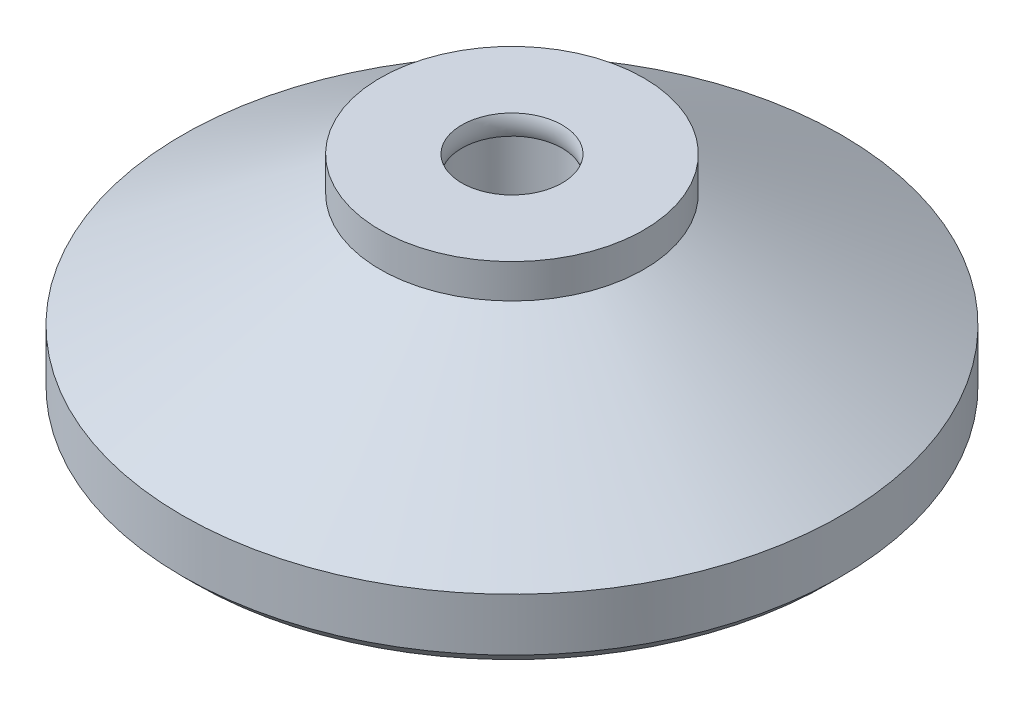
ISO-10303-21;
HEADER;
FILE_DESCRIPTION(('STEP AP214'),'2;1');
FILE_NAME('part.step','',(''),(''),'','','');
FILE_SCHEMA(('AUTOMOTIVE_DESIGN { 1 0 10303 214 1 1 1 1 }'));
ENDSEC;
DATA;
#1=APPLICATION_CONTEXT('core data for automotive mechanical design processes');
#2=APPLICATION_PROTOCOL_DEFINITION('international standard','automotive_design',2000,#1);
#3=PRODUCT_CONTEXT('',#1,'mechanical');
#4=PRODUCT('Part','Part','',(#3));
#5=PRODUCT_RELATED_PRODUCT_CATEGORY('part','',(#4));
#6=PRODUCT_DEFINITION_FORMATION('','',#4);
#7=PRODUCT_DEFINITION_CONTEXT('part definition',#1,'design');
#8=PRODUCT_DEFINITION('design','',#6,#7);
#9=PRODUCT_DEFINITION_SHAPE('','',#8);
#10=(LENGTH_UNIT() NAMED_UNIT(*) SI_UNIT(.MILLI.,.METRE.));
#11=(NAMED_UNIT(*) PLANE_ANGLE_UNIT() SI_UNIT($,.RADIAN.));
#12=(NAMED_UNIT(*) SI_UNIT($,.STERADIAN.) SOLID_ANGLE_UNIT());
#13=UNCERTAINTY_MEASURE_WITH_UNIT(LENGTH_MEASURE(1.E-05),#10,'distance_accuracy_value','');
#14=(GEOMETRIC_REPRESENTATION_CONTEXT(3) GLOBAL_UNCERTAINTY_ASSIGNED_CONTEXT((#13)) GLOBAL_UNIT_ASSIGNED_CONTEXT((#10,
#11,#12)) REPRESENTATION_CONTEXT('',''));
#15=CARTESIAN_POINT('',(0.,0.,0.));
#16=DIRECTION('',(0.,0.,1.));
#17=DIRECTION('',(1.,0.,0.));
#18=AXIS2_PLACEMENT_3D('',#15,#16,#17);
#19=CARTESIAN_POINT('',(0.,6.5,0.));
#20=DIRECTION('',(0.,-1.,0.));
#21=DIRECTION('',(0.,0.,-1.));
#22=AXIS2_PLACEMENT_3D('',#19,#20,#21);
#23=CYLINDRICAL_SURFACE('',#22,8.);
#24=CARTESIAN_POINT('',(0.,4.42820323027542,0.));
#25=DIRECTION('',(0.,1.,0.));
#26=DIRECTION('',(0.,0.,1.));
#27=AXIS2_PLACEMENT_3D('',#24,#25,#26);
#28=CIRCLE('',#27,8.);
#29=CARTESIAN_POINT('',(0.,4.42820323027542,-8.));
#30=VERTEX_POINT('',#29);
#31=EDGE_CURVE('E91',#30,#30,#28,.T.);
#32=CARTESIAN_POINT('',(0.,6.5,0.));
#33=DIRECTION('',(0.,1.,0.));
#34=DIRECTION('',(0.,0.,1.));
#35=AXIS2_PLACEMENT_3D('',#32,#33,#34);
#36=CIRCLE('',#35,8.);
#37=CARTESIAN_POINT('',(0.,6.5,-8.));
#38=VERTEX_POINT('',#37);
#39=EDGE_CURVE('E93',#38,#38,#36,.T.);
#40=CARTESIAN_POINT('',(0.,4.42820323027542,-8.));
#41=CARTESIAN_POINT('',(0.,4.44978444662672,-8.));
#42=CARTESIAN_POINT('',(0.,4.47136566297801,-8.));
#43=CARTESIAN_POINT('',(0.,4.51452809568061,-8.));
#44=CARTESIAN_POINT('',(0.,4.53610931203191,-8.));
#45=CARTESIAN_POINT('',(0.,4.5792717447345,-8.));
#46=CARTESIAN_POINT('',(0.,4.6008529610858,-8.));
#47=CARTESIAN_POINT('',(0.,4.6440153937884,-8.));
#48=CARTESIAN_POINT('',(0.,4.66559661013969,-8.));
#49=CARTESIAN_POINT('',(0.,4.70875904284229,-8.));
#50=CARTESIAN_POINT('',(0.,4.73034025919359,-8.));
#51=CARTESIAN_POINT('',(0.,4.77350269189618,-8.));
#52=CARTESIAN_POINT('',(0.,4.79508390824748,-8.));
#53=CARTESIAN_POINT('',(0.,4.83824634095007,-8.));
#54=CARTESIAN_POINT('',(0.,4.85982755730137,-8.));
#55=CARTESIAN_POINT('',(0.,4.90298999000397,-8.));
#56=CARTESIAN_POINT('',(0.,4.92457120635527,-8.));
#57=CARTESIAN_POINT('',(0.,4.96773363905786,-8.));
#58=CARTESIAN_POINT('',(0.,4.98931485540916,-8.));
#59=CARTESIAN_POINT('',(0.,5.03247728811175,-8.));
#60=CARTESIAN_POINT('',(0.,5.05405850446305,-8.));
#61=CARTESIAN_POINT('',(0.,5.09722093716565,-8.));
#62=CARTESIAN_POINT('',(0.,5.11880215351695,-8.));
#63=CARTESIAN_POINT('',(0.,5.16196458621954,-8.));
#64=CARTESIAN_POINT('',(0.,5.18354580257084,-8.));
#65=CARTESIAN_POINT('',(0.,5.22670823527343,-8.));
#66=CARTESIAN_POINT('',(0.,5.24828945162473,-8.));
#67=CARTESIAN_POINT('',(0.,5.29145188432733,-8.));
#68=CARTESIAN_POINT('',(0.,5.31303310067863,-8.));
#69=CARTESIAN_POINT('',(0.,5.35619553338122,-8.));
#70=CARTESIAN_POINT('',(0.,5.37777674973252,-8.));
#71=CARTESIAN_POINT('',(0.,5.42093918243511,-8.));
#72=CARTESIAN_POINT('',(0.,5.44252039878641,-8.));
#73=CARTESIAN_POINT('',(0.,5.48568283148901,-8.));
#74=CARTESIAN_POINT('',(0.,5.5072640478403,-8.));
#75=CARTESIAN_POINT('',(0.,5.5504264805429,-8.));
#76=CARTESIAN_POINT('',(0.,5.5720076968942,-8.));
#77=CARTESIAN_POINT('',(0.,5.61517012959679,-8.));
#78=CARTESIAN_POINT('',(0.,5.63675134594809,-8.));
#79=CARTESIAN_POINT('',(0.,5.67991377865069,-8.));
#80=CARTESIAN_POINT('',(0.,5.70149499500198,-8.));
#81=CARTESIAN_POINT('',(0.,5.74465742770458,-8.));
#82=CARTESIAN_POINT('',(0.,5.76623864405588,-8.));
#83=CARTESIAN_POINT('',(0.,5.80940107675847,-8.));
#84=CARTESIAN_POINT('',(0.,5.83098229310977,-8.));
#85=CARTESIAN_POINT('',(0.,5.87414472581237,-8.));
#86=CARTESIAN_POINT('',(0.,5.89572594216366,-8.));
#87=CARTESIAN_POINT('',(0.,5.93888837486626,-8.));
#88=CARTESIAN_POINT('',(0.,5.96046959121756,-8.));
#89=CARTESIAN_POINT('',(0.,6.00363202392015,-8.));
#90=CARTESIAN_POINT('',(0.,6.02521324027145,-8.));
#91=CARTESIAN_POINT('',(0.,6.06837567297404,-8.));
#92=CARTESIAN_POINT('',(0.,6.08995688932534,-8.));
#93=CARTESIAN_POINT('',(0.,6.13311932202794,-8.));
#94=CARTESIAN_POINT('',(0.,6.15470053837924,-8.));
#95=CARTESIAN_POINT('',(0.,6.19786297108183,-8.));
#96=CARTESIAN_POINT('',(0.,6.21944418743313,-8.));
#97=CARTESIAN_POINT('',(0.,6.26260662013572,-8.));
#98=CARTESIAN_POINT('',(0.,6.28418783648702,-8.));
#99=CARTESIAN_POINT('',(0.,6.32735026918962,-8.));
#100=CARTESIAN_POINT('',(0.,6.34893148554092,-8.));
#101=CARTESIAN_POINT('',(0.,6.39209391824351,-8.));
#102=CARTESIAN_POINT('',(0.,6.41367513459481,-8.));
#103=CARTESIAN_POINT('',(0.,6.4568375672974,-8.));
#104=CARTESIAN_POINT('',(0.,6.4784187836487,-8.));
#105=CARTESIAN_POINT('',(0.,6.5,-8.));
#106=B_SPLINE_CURVE_WITH_KNOTS('',3,(#40,#41,#42,#43,#44,#45,#46,#47,#48,#49,#50,#51,#52,#53,
#54,#55,#56,#57,#58,#59,#60,#61,#62,#63,#64,#65,#66,#67,#68,#69,#70,#71,#72,#73,#74,#75,#76,#77,
#78,#79,#80,#81,#82,#83,#84,#85,#86,#87,#88,#89,#90,#91,#92,#93,#94,#95,#96,#97,#98,#99,#100,
#101,#102,#103,#104,#105),.UNSPECIFIED.,.F.,.F.,(4,2,2,2,2,2,2,2,2,2,2,2,2,2,2,2,2,2,2,2,2,2,2,
2,2,2,2,2,2,2,2,2,4),(0.,0.064743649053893,0.129487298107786,0.194230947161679,
0.258974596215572,0.323718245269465,0.388461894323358,0.453205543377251,0.517949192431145,
0.582692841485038,0.647436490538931,0.712180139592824,0.776923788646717,0.841667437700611,
0.906411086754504,0.971154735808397,1.03589838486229,1.10064203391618,1.16538568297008,
1.23012933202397,1.29487298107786,1.35961663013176,1.42436027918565,1.48910392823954,
1.55384757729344,1.61859122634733,1.68333487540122,1.74807852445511,1.81282217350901,
1.8775658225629,1.94230947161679,2.00705312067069,2.07179676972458),.UNSPECIFIED.);
#107=EDGE_CURVE('BSEAM37',#30,#38,#106,.T.);
#108=ORIENTED_EDGE('',*,*,#31,.T.);
#109=ORIENTED_EDGE('',*,*,#39,.F.);
#110=ORIENTED_EDGE('',*,*,#107,.T.);
#111=ORIENTED_EDGE('',*,*,#107,.F.);
#112=EDGE_LOOP('',(#108,#110,#109,#111));
#113=FACE_BOUND('',#112,.T.);
#114=ADVANCED_FACE('F37',(#113),#23,.T.);
#115=CARTESIAN_POINT('',(0.,6.5,0.));
#116=DIRECTION('',(0.,1.,0.));
#117=DIRECTION('',(0.,0.,1.));
#118=AXIS2_PLACEMENT_3D('',#115,#116,#117);
#119=PLANE('',#118);
#120=CARTESIAN_POINT('',(0.,6.5,0.));
#121=DIRECTION('',(0.,-1.,0.));
#122=DIRECTION('',(0.,0.,-1.));
#123=AXIS2_PLACEMENT_3D('',#120,#121,#122);
#124=CIRCLE('',#123,3.05);
#125=CARTESIAN_POINT('',(0.,6.5,-3.05));
#126=VERTEX_POINT('',#125);
#127=EDGE_CURVE('E111',#126,#126,#124,.T.);
#128=ORIENTED_EDGE('',*,*,#127,.T.);
#129=EDGE_LOOP('',(#128));
#130=FACE_BOUND('',#129,.T.);
#131=ORIENTED_EDGE('',*,*,#39,.T.);
#132=EDGE_LOOP('',(#131));
#133=FACE_BOUND('',#132,.T.);
#134=ADVANCED_FACE('F65',(#130,#133),#119,.T.);
#135=CARTESIAN_POINT('',(0.,4.42820323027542,0.));
#136=DIRECTION('',(0.,-1.,0.));
#137=DIRECTION('',(0.,0.,-1.));
#138=AXIS2_PLACEMENT_3D('',#135,#136,#137);
#139=CONICAL_SURFACE('',#138,8.,1.0471975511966);
#140=CARTESIAN_POINT('',(0.,-2.5,0.));
#141=DIRECTION('',(0.,1.,0.));
#142=DIRECTION('',(0.,0.,1.));
#143=AXIS2_PLACEMENT_3D('',#140,#141,#142);
#144=CIRCLE('',#143,20.);
#145=CARTESIAN_POINT('',(0.,-2.5,20.));
#146=VERTEX_POINT('',#145);
#147=EDGE_CURVE('E89',#146,#146,#144,.T.);
#148=ORIENTED_EDGE('',*,*,#147,.T.);
#149=EDGE_LOOP('',(#148));
#150=FACE_BOUND('',#149,.T.);
#151=ORIENTED_EDGE('',*,*,#31,.F.);
#152=EDGE_LOOP('',(#151));
#153=FACE_BOUND('',#152,.T.);
#154=ADVANCED_FACE('F70',(#150,#153),#139,.T.);
#155=CARTESIAN_POINT('',(0.,-6.5,0.));
#156=DIRECTION('',(0.,1.,0.));
#157=DIRECTION('',(0.,0.,1.));
#158=AXIS2_PLACEMENT_3D('',#155,#156,#157);
#159=PLANE('',#158);
#160=CARTESIAN_POINT('',(0.,-6.5,0.));
#161=DIRECTION('',(0.,1.,0.));
#162=DIRECTION('',(0.,0.,1.));
#163=AXIS2_PLACEMENT_3D('',#160,#161,#162);
#164=CIRCLE('',#163,19.2);
#165=CARTESIAN_POINT('',(0.,-6.5,19.2));
#166=VERTEX_POINT('',#165);
#167=EDGE_CURVE('E45',#166,#166,#164,.F.);
#168=ORIENTED_EDGE('',*,*,#167,.T.);
#169=EDGE_LOOP('',(#168));
#170=FACE_BOUND('',#169,.T.);
#171=ADVANCED_FACE('F76',(#170),#159,.F.);
#172=CARTESIAN_POINT('',(0.,-2.5,0.));
#173=DIRECTION('',(0.,-1.,0.));
#174=DIRECTION('',(0.,0.,-1.));
#175=AXIS2_PLACEMENT_3D('',#172,#173,#174);
#176=CYLINDRICAL_SURFACE('',#175,20.);
#177=CARTESIAN_POINT('',(0.,-5.69999999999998,0.));
#178=DIRECTION('',(0.,1.,0.));
#179=DIRECTION('',(0.,0.,1.));
#180=AXIS2_PLACEMENT_3D('',#177,#178,#179);
#181=CIRCLE('',#180,20.);
#182=CARTESIAN_POINT('',(0.,-5.69999999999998,20.));
#183=VERTEX_POINT('',#182);
#184=EDGE_CURVE('E11',#183,#183,#181,.T.);
#185=ORIENTED_EDGE('',*,*,#184,.T.);
#186=EDGE_LOOP('',(#185));
#187=FACE_BOUND('',#186,.T.);
#188=ORIENTED_EDGE('',*,*,#147,.F.);
#189=EDGE_LOOP('',(#188));
#190=FACE_BOUND('',#189,.T.);
#191=ADVANCED_FACE('F60',(#187,#190),#176,.T.);
#192=CARTESIAN_POINT('',(0.,-6.5,0.));
#193=DIRECTION('',(0.,1.,0.));
#194=DIRECTION('',(0.,0.,1.));
#195=AXIS2_PLACEMENT_3D('',#192,#193,#194);
#196=CONICAL_SURFACE('',#195,19.2,0.78539816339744);
#197=CARTESIAN_POINT('',(0.,-5.69999999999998,20.));
#198=CARTESIAN_POINT('',(0.,-5.70833333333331,19.9916666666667));
#199=CARTESIAN_POINT('',(0.,-5.71666666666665,19.9833333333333));
#200=CARTESIAN_POINT('',(0.,-5.73333333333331,19.9666666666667));
#201=CARTESIAN_POINT('',(0.,-5.74166666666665,19.9583333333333));
#202=CARTESIAN_POINT('',(0.,-5.75833333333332,19.9416666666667));
#203=CARTESIAN_POINT('',(0.,-5.76666666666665,19.9333333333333));
#204=CARTESIAN_POINT('',(0.,-5.78333333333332,19.9166666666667));
#205=CARTESIAN_POINT('',(0.,-5.79166666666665,19.9083333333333));
#206=CARTESIAN_POINT('',(0.,-5.80833333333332,19.8916666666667));
#207=CARTESIAN_POINT('',(0.,-5.81666666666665,19.8833333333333));
#208=CARTESIAN_POINT('',(0.,-5.83333333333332,19.8666666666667));
#209=CARTESIAN_POINT('',(0.,-5.84166666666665,19.8583333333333));
#210=CARTESIAN_POINT('',(0.,-5.85833333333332,19.8416666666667));
#211=CARTESIAN_POINT('',(0.,-5.86666666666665,19.8333333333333));
#212=CARTESIAN_POINT('',(0.,-5.88333333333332,19.8166666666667));
#213=CARTESIAN_POINT('',(0.,-5.89166666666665,19.8083333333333));
#214=CARTESIAN_POINT('',(0.,-5.90833333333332,19.7916666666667));
#215=CARTESIAN_POINT('',(0.,-5.91666666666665,19.7833333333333));
#216=CARTESIAN_POINT('',(0.,-5.93333333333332,19.7666666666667));
#217=CARTESIAN_POINT('',(0.,-5.94166666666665,19.7583333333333));
#218=CARTESIAN_POINT('',(0.,-5.95833333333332,19.7416666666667));
#219=CARTESIAN_POINT('',(0.,-5.96666666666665,19.7333333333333));
#220=CARTESIAN_POINT('',(0.,-5.98333333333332,19.7166666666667));
#221=CARTESIAN_POINT('',(0.,-5.99166666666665,19.7083333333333));
#222=CARTESIAN_POINT('',(0.,-6.00833333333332,19.6916666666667));
#223=CARTESIAN_POINT('',(0.,-6.01666666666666,19.6833333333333));
#224=CARTESIAN_POINT('',(0.,-6.03333333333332,19.6666666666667));
#225=CARTESIAN_POINT('',(0.,-6.04166666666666,19.6583333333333));
#226=CARTESIAN_POINT('',(0.,-6.05833333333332,19.6416666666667));
#227=CARTESIAN_POINT('',(0.,-6.06666666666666,19.6333333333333));
#228=CARTESIAN_POINT('',(0.,-6.08333333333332,19.6166666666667));
#229=CARTESIAN_POINT('',(0.,-6.09166666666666,19.6083333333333));
#230=CARTESIAN_POINT('',(0.,-6.10833333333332,19.5916666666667));
#231=CARTESIAN_POINT('',(0.,-6.11666666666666,19.5833333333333));
#232=CARTESIAN_POINT('',(0.,-6.13333333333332,19.5666666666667));
#233=CARTESIAN_POINT('',(0.,-6.14166666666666,19.5583333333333));
#234=CARTESIAN_POINT('',(0.,-6.15833333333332,19.5416666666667));
#235=CARTESIAN_POINT('',(0.,-6.16666666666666,19.5333333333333));
#236=CARTESIAN_POINT('',(0.,-6.18333333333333,19.5166666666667));
#237=CARTESIAN_POINT('',(0.,-6.19166666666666,19.5083333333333));
#238=CARTESIAN_POINT('',(0.,-6.20833333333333,19.4916666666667));
#239=CARTESIAN_POINT('',(0.,-6.21666666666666,19.4833333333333));
#240=CARTESIAN_POINT('',(0.,-6.23333333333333,19.4666666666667));
#241=CARTESIAN_POINT('',(0.,-6.24166666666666,19.4583333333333));
#242=CARTESIAN_POINT('',(0.,-6.25833333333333,19.4416666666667));
#243=CARTESIAN_POINT('',(0.,-6.26666666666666,19.4333333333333));
#244=CARTESIAN_POINT('',(0.,-6.28333333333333,19.4166666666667));
#245=CARTESIAN_POINT('',(0.,-6.29166666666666,19.4083333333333));
#246=CARTESIAN_POINT('',(0.,-6.30833333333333,19.3916666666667));
#247=CARTESIAN_POINT('',(0.,-6.31666666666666,19.3833333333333));
#248=CARTESIAN_POINT('',(0.,-6.33333333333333,19.3666666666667));
#249=CARTESIAN_POINT('',(0.,-6.34166666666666,19.3583333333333));
#250=CARTESIAN_POINT('',(0.,-6.35833333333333,19.3416666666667));
#251=CARTESIAN_POINT('',(0.,-6.36666666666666,19.3333333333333));
#252=CARTESIAN_POINT('',(0.,-6.38333333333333,19.3166666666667));
#253=CARTESIAN_POINT('',(0.,-6.39166666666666,19.3083333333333));
#254=CARTESIAN_POINT('',(0.,-6.40833333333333,19.2916666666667));
#255=CARTESIAN_POINT('',(0.,-6.41666666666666,19.2833333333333));
#256=CARTESIAN_POINT('',(0.,-6.43333333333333,19.2666666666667));
#257=CARTESIAN_POINT('',(0.,-6.44166666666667,19.2583333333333));
#258=CARTESIAN_POINT('',(0.,-6.45833333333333,19.2416666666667));
#259=CARTESIAN_POINT('',(0.,-6.46666666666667,19.2333333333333));
#260=CARTESIAN_POINT('',(0.,-6.48333333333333,19.2166666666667));
#261=CARTESIAN_POINT('',(0.,-6.49166666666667,19.2083333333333));
#262=CARTESIAN_POINT('',(0.,-6.5,19.2));
#263=B_SPLINE_CURVE_WITH_KNOTS('',3,(#197,#198,#199,#200,#201,#202,#203,#204,#205,#206,#207,
#208,#209,#210,#211,#212,#213,#214,#215,#216,#217,#218,#219,#220,#221,#222,#223,#224,#225,#226,
#227,#228,#229,#230,#231,#232,#233,#234,#235,#236,#237,#238,#239,#240,#241,#242,#243,#244,#245,
#246,#247,#248,#249,#250,#251,#252,#253,#254,#255,#256,#257,#258,#259,#260,#261,#262),
.UNSPECIFIED.,.F.,.F.,(4,2,2,2,2,2,2,2,2,2,2,2,2,2,2,2,2,2,2,2,2,2,2,2,2,2,2,2,2,2,2,2,4),(0.,
0.0353553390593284,0.0707106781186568,0.106066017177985,0.141421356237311,0.17677669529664,
0.212132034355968,0.247487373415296,0.282842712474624,0.318198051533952,0.353553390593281,
0.388908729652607,0.424264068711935,0.459619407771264,0.494974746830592,0.53033008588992,
0.565685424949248,0.601040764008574,0.636396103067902,0.671751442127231,0.707106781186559,
0.742462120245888,0.777817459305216,0.813172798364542,0.84852813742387,0.883883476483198,
0.919238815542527,0.954594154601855,0.989949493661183,1.02530483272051,1.06066017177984,
1.09601551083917,1.13137084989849),.UNSPECIFIED.);
#264=EDGE_CURVE('BSEAM39',#183,#166,#263,.T.);
#265=ORIENTED_EDGE('',*,*,#184,.F.);
#266=ORIENTED_EDGE('',*,*,#167,.F.);
#267=ORIENTED_EDGE('',*,*,#264,.T.);
#268=ORIENTED_EDGE('',*,*,#264,.F.);
#269=EDGE_LOOP('',(#265,#267,#266,#268));
#270=FACE_BOUND('',#269,.T.);
#271=ADVANCED_FACE('F39',(#270),#196,.T.);
#272=CARTESIAN_POINT('',(0.,-2.5,0.));
#273=DIRECTION('',(0.,1.,0.));
#274=DIRECTION('',(0.,0.,1.));
#275=AXIS2_PLACEMENT_3D('',#272,#273,#274);
#276=CONICAL_SURFACE('',#275,0.,1.04719755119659);
#277=CARTESIAN_POINT('',(0.,-0.739081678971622,0.));
#278=DIRECTION('',(0.,-1.,0.));
#279=DIRECTION('',(0.,0.,-1.));
#280=AXIS2_PLACEMENT_3D('',#277,#278,#279);
#281=CIRCLE('',#280,3.05);
#282=CARTESIAN_POINT('',(0.,-0.739081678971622,-3.05));
#283=VERTEX_POINT('',#282);
#284=EDGE_CURVE('E100',#283,#283,#281,.T.);
#285=ORIENTED_EDGE('',*,*,#284,.F.);
#286=EDGE_LOOP('',(#285));
#287=FACE_BOUND('',#286,.T.);
#288=CARTESIAN_POINT('',(0.,-2.5,0.));
#289=VERTEX_POINT('',#288);
#290=VERTEX_LOOP('',#289);
#291=FACE_BOUND('',#290,.T.);
#292=ADVANCED_FACE('F48',(#287,#291),#276,.F.);
#293=CARTESIAN_POINT('',(0.,0.,0.));
#294=DIRECTION('',(0.,-1.,0.));
#295=DIRECTION('',(0.,0.,-1.));
#296=AXIS2_PLACEMENT_3D('',#293,#294,#295);
#297=CYLINDRICAL_SURFACE('',#296,3.05);
#298=CARTESIAN_POINT('',(0.,5.28,0.));
#299=DIRECTION('',(0.,-1.,0.));
#300=DIRECTION('',(0.,0.,-1.));
#301=AXIS2_PLACEMENT_3D('',#298,#299,#300);
#302=CIRCLE('',#301,3.05);
#303=CARTESIAN_POINT('',(0.,5.28,-3.05));
#304=VERTEX_POINT('',#303);
#305=EDGE_CURVE('E110',#304,#304,#302,.T.);
#306=ORIENTED_EDGE('',*,*,#305,.F.);
#307=EDGE_LOOP('',(#306));
#308=FACE_BOUND('',#307,.T.);
#309=ORIENTED_EDGE('',*,*,#284,.T.);
#310=EDGE_LOOP('',(#309));
#311=FACE_BOUND('',#310,.T.);
#312=ADVANCED_FACE('F50',(#308,#311),#297,.F.);
#313=CARTESIAN_POINT('',(0.,5.89,0.));
#314=DIRECTION('',(0.,-1.,0.));
#315=DIRECTION('',(0.,0.,-1.));
#316=AXIS2_PLACEMENT_3D('',#313,#314,#315);
#317=TOROIDAL_SURFACE('',#316,4.51399999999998,1.58599999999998);
#318=ORIENTED_EDGE('',*,*,#127,.F.);
#319=EDGE_LOOP('',(#318));
#320=FACE_BOUND('',#319,.T.);
#321=ORIENTED_EDGE('',*,*,#305,.T.);
#322=EDGE_LOOP('',(#321));
#323=FACE_BOUND('',#322,.T.);
#324=ADVANCED_FACE('F57',(#320,#323),#317,.T.);
#325=CLOSED_SHELL('',(#114,#134,#154,#171,#191,#271,#292,#312,#324));
#326=MANIFOLD_SOLID_BREP('B2',#325);
#327=ADVANCED_BREP_SHAPE_REPRESENTATION('',(#18,#326),#14);
#328=SHAPE_DEFINITION_REPRESENTATION(#9,#327);
ENDSEC;
END-ISO-10303-21;
